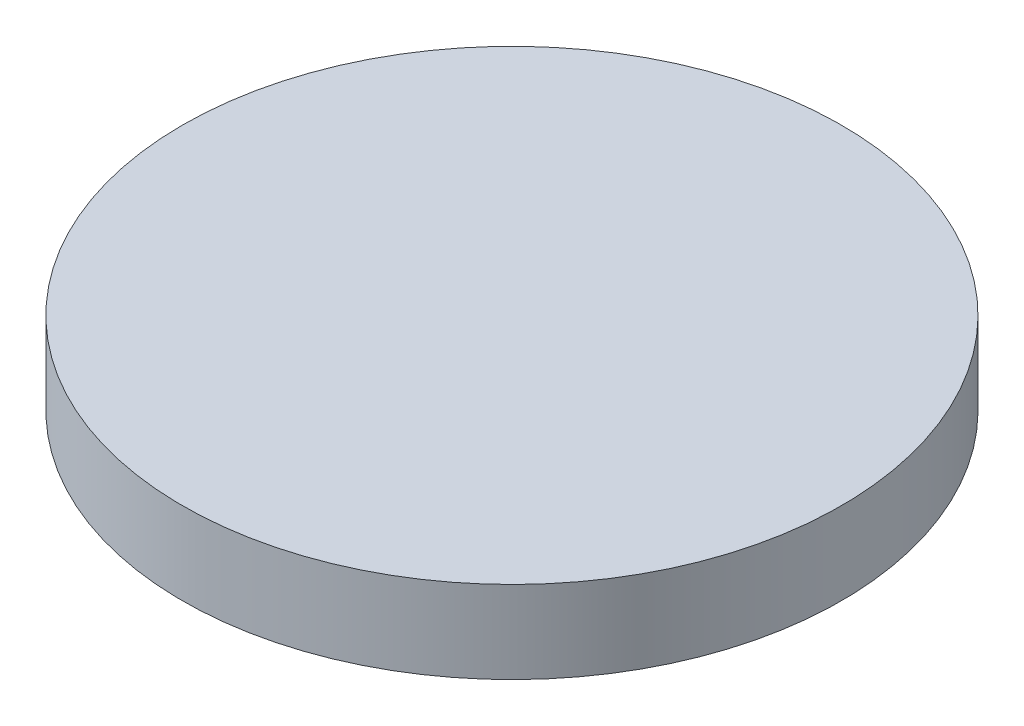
from build123d import *


with BuildPart() as part:
    # Sketch1 → Revolve1 (revolve)
    with BuildSketch(Plane.XY, mode=Mode.PRIVATE) as revolve1_sk:
        with BuildLine():
            Line((25.4, 12.7), (25.4, 19.05))
            Line((25.4, 19.05), (0, 19.05))
            Line((0, 19.05), (0, 6.35))
            ThreePointArc((0, 6.35), (13.090860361, 7.961558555), (25.4, 12.7))
        make_face()
    revolve(revolve1_sk.sketch.rotate(Axis((0, 0, 0), (0, -1, 0)), 180), axis=Axis((0, 0, 0), (0, -1, 0)))


solid = part.part
